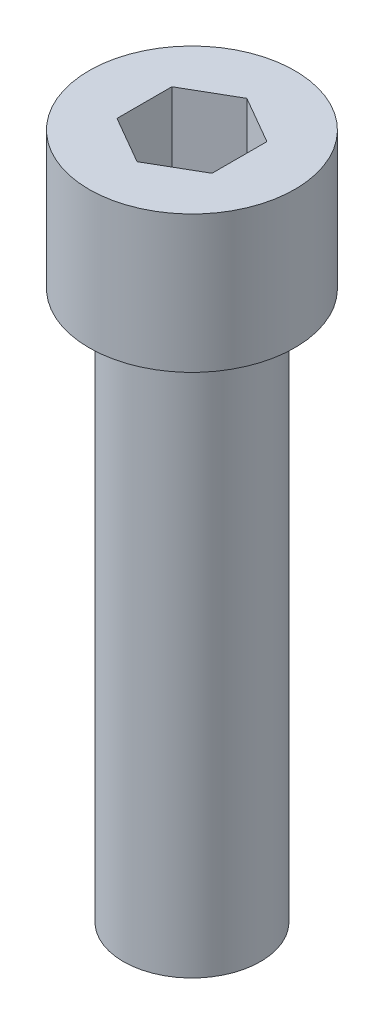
from build123d import *

# Parameters (mm, degrees)
CUT_EXTRUDE1_DEPTH = 6.35


with BuildPart() as part:
    # Sketch1 → Revolve1 (revolve)
    with BuildSketch(Plane.XY, mode=Mode.PRIVATE) as revolve1_sk:
        Polygon((0, 0), (-4.7625, 0), (-4.7625, -6.35), (-3.175, -6.35), (-3.175, -31.75), (0, -31.75), align=None)
    revolve(revolve1_sk.sketch.rotate(Axis((0, 66.04, 0), (0, -1, 0)), 270), axis=Axis((0, 66.04, 0), (0, -1, 0)))

    # Sketch2 → Cut-Extrude1 (cut)
    with BuildSketch(Plane(origin=(0, 0, 0), x_dir=(-1, 0, 0), z_dir=(0, 1, 0))):
        Polygon((0, -2.54), (2.199704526, -1.27), (2.199704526, 1.27), (0, 2.54), (-2.199704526, 1.27), (-2.199704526, -1.27), align=None)
    extrude(amount=-CUT_EXTRUDE1_DEPTH, mode=Mode.SUBTRACT)


solid = part.part
